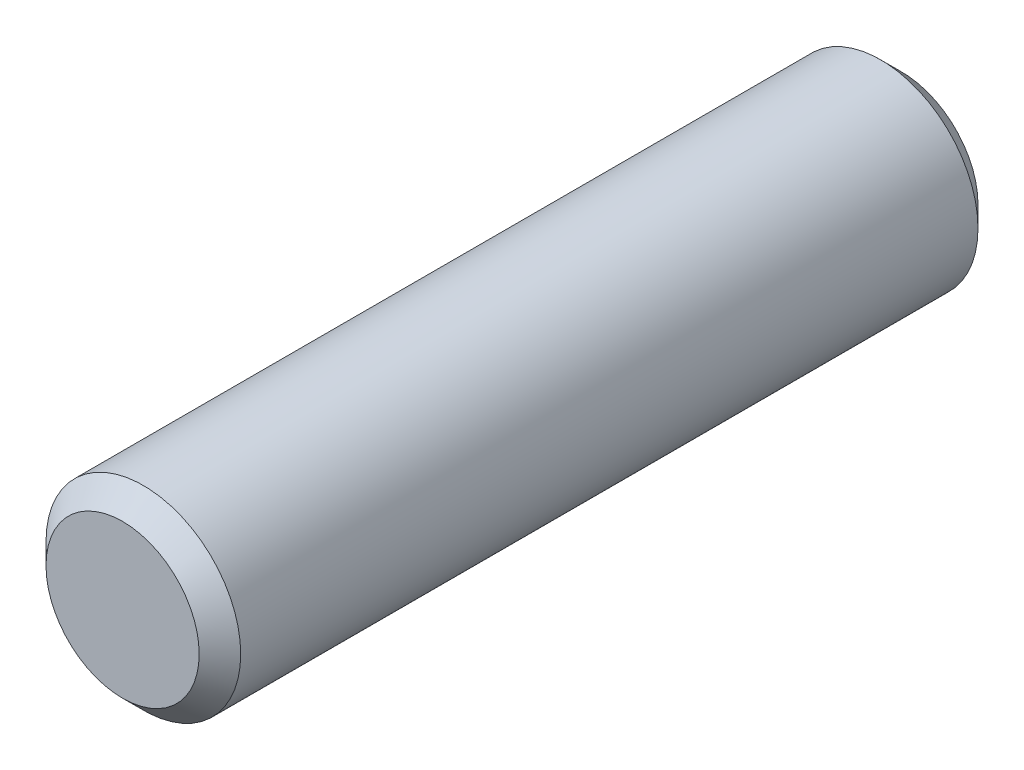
from build123d import *

# Parameters (mm, degrees)
SKETCH1_R      = 2.38125
EXTRUDE1_DEPTH = 9.525
CHAMFER1_SIZE  = 0.508


with BuildPart() as part:
    # Sketch1 → Extrude1 (new, symmetric)
    with BuildSketch(Plane.XY):
        with Locations(Location((0, 0, 0), (0, 0, 180))):
            Circle(SKETCH1_R)
    extrude(amount=EXTRUDE1_DEPTH, both=True)

    # Chamfer1
    chamfer1_edges = [part.edges().sort_by_distance(p)[0] for p in [
        (2.38125, 0, -9.525),
        (2.38125, 0, 9.525),
    ]]
    chamfer(chamfer1_edges, length=CHAMFER1_SIZE)


solid = part.part
